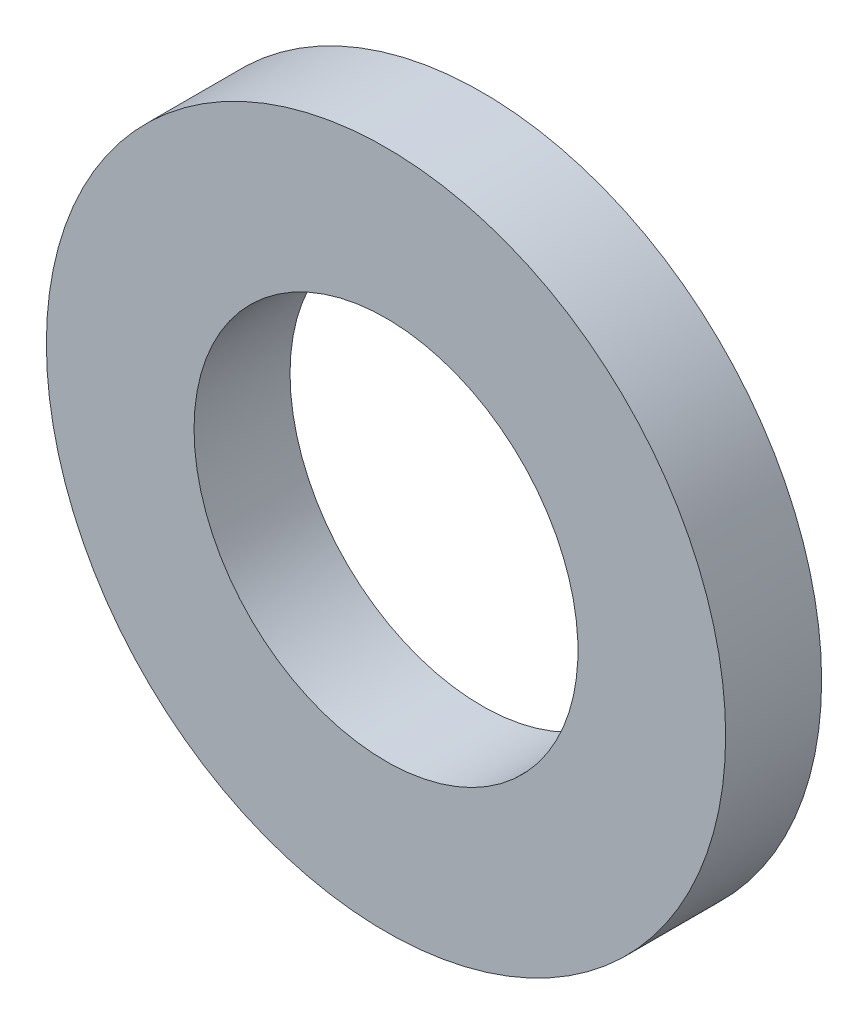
from build123d import *

# Parameters (mm, degrees)
SKETCH1_R           = 5.842
SKETCH1_R_2         = 3.302
BOSS_EXTRUDE1_DEPTH = 1.651


with BuildPart() as part:
    # Sketch1 → Boss-Extrude1 (new body)
    with BuildSketch(Plane.XY):
        with Locations(Location((0, 0, 0), (0, 0, 180))):
            Circle(SKETCH1_R)
        with Locations(Location((0, 0, 0), (0, 0, 180))):
            Circle(SKETCH1_R_2, mode=Mode.SUBTRACT)
    extrude(amount=BOSS_EXTRUDE1_DEPTH)


solid = part.part
